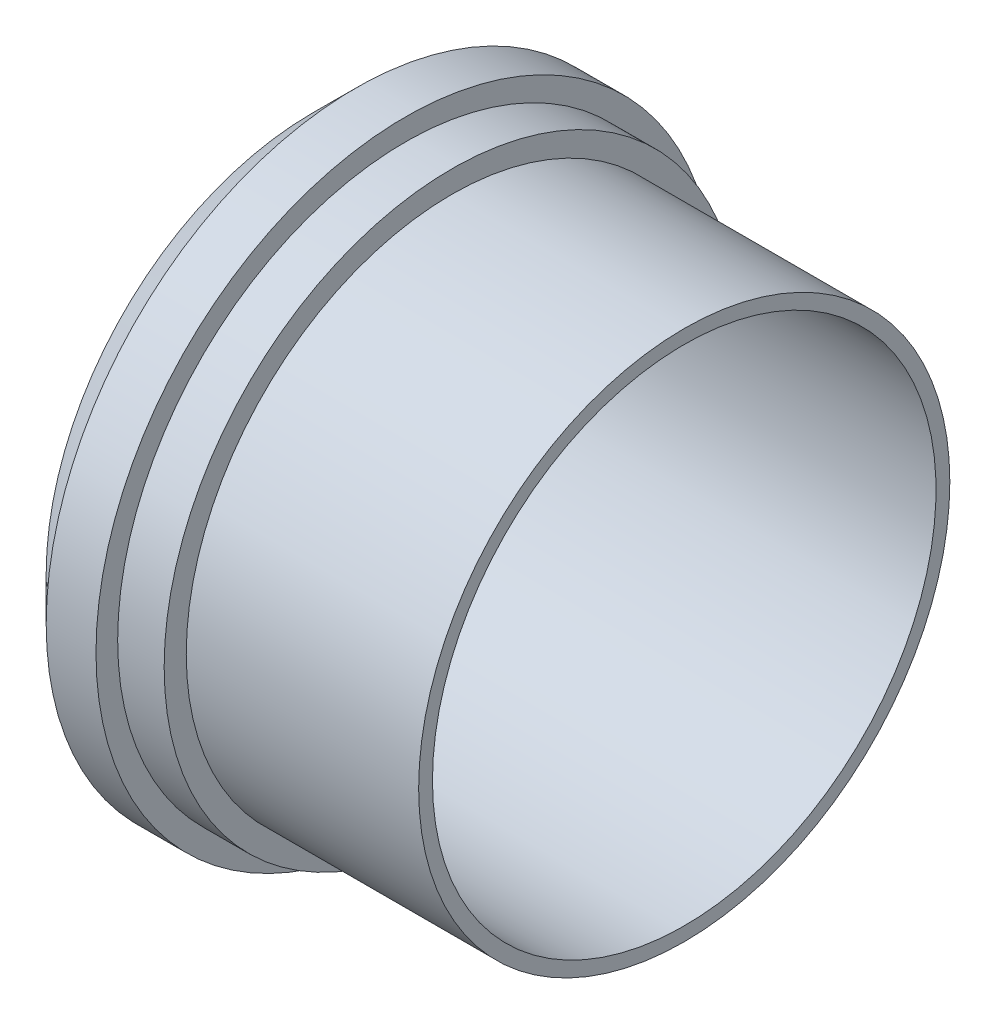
from build123d import *

# Parameters (mm, degrees)
SKETCH4_R          = 30.099
CUT_EXTRUDE1_DEPTH = 44.45


with BuildPart() as part:
    # Sketch1 → Revolve1 (revolve)
    with BuildSketch(Plane.XY, mode=Mode.PRIVATE) as revolve1_sk:
        Polygon((0, 0), (-27.77998, 0), (-27.77998, -2.6416), (-33.3375, -2.6416), (-33.3375, -5.2324), (-39.29126, -5.2324), (-44.45, -0.0762), (-44.45, 31.75), (0, 31.75), align=None)
    revolve(revolve1_sk.sketch.rotate(Axis((-44.45, 31.75, 0), (1, 0, 0)), 270), axis=Axis((-44.45, 31.75, 0), (1, 0, 0)))

    # Sketch4 → Cut-Extrude1 (cut)
    with BuildSketch(Plane.ZY.offset(44.45)):
        with Locations((0, 31.75)):
            Circle(SKETCH4_R)
    extrude(amount=-CUT_EXTRUDE1_DEPTH, mode=Mode.SUBTRACT)


solid = part.part
